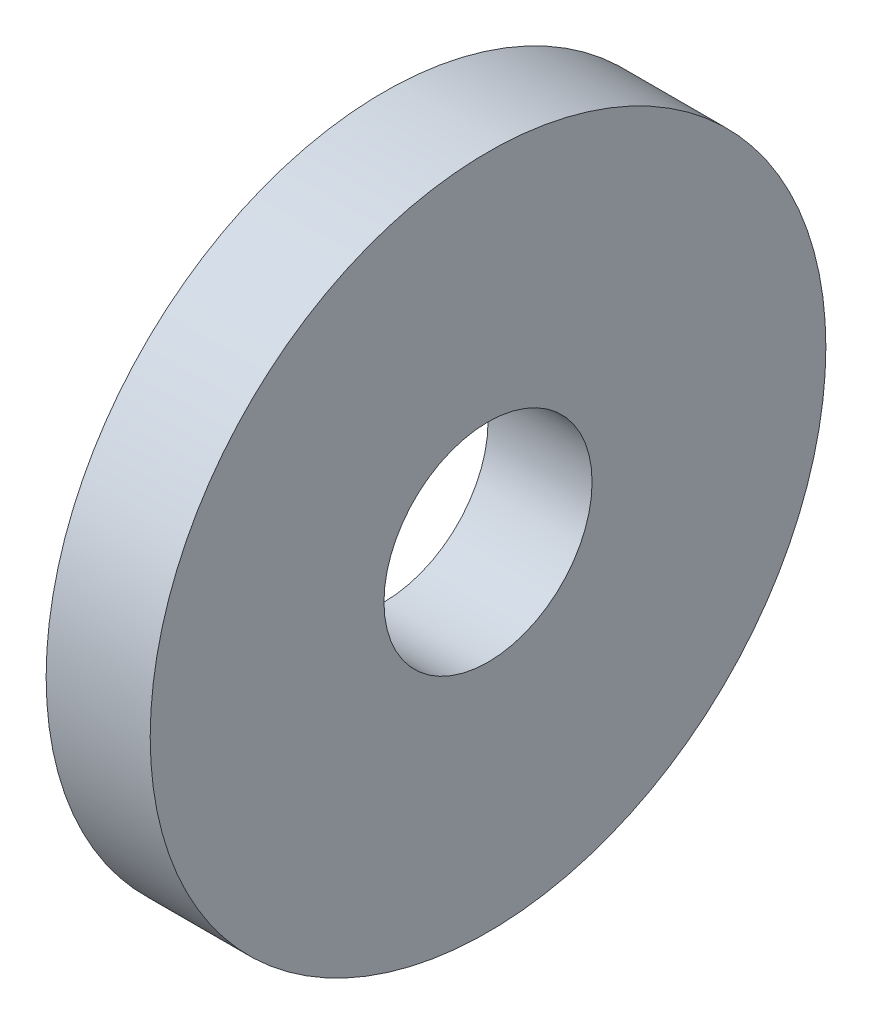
from build123d import *

# Parameters (mm, degrees)
ESBO_O1_R                = 9.74
ESBO_O1_R_2              = 3
RESSALTO_EXTRUS_O1_DEPTH = 3


with BuildPart() as part:
    # Esbo_o1 → Ressalto-extrus_o1 (new body)
    with BuildSketch(Plane(origin=(0, 0, 0), x_dir=(0, 0, -1), z_dir=(1, 0, 0))):
        Circle(ESBO_O1_R)
        Circle(ESBO_O1_R_2, mode=Mode.SUBTRACT)
    extrude(amount=RESSALTO_EXTRUS_O1_DEPTH)


solid = part.part
